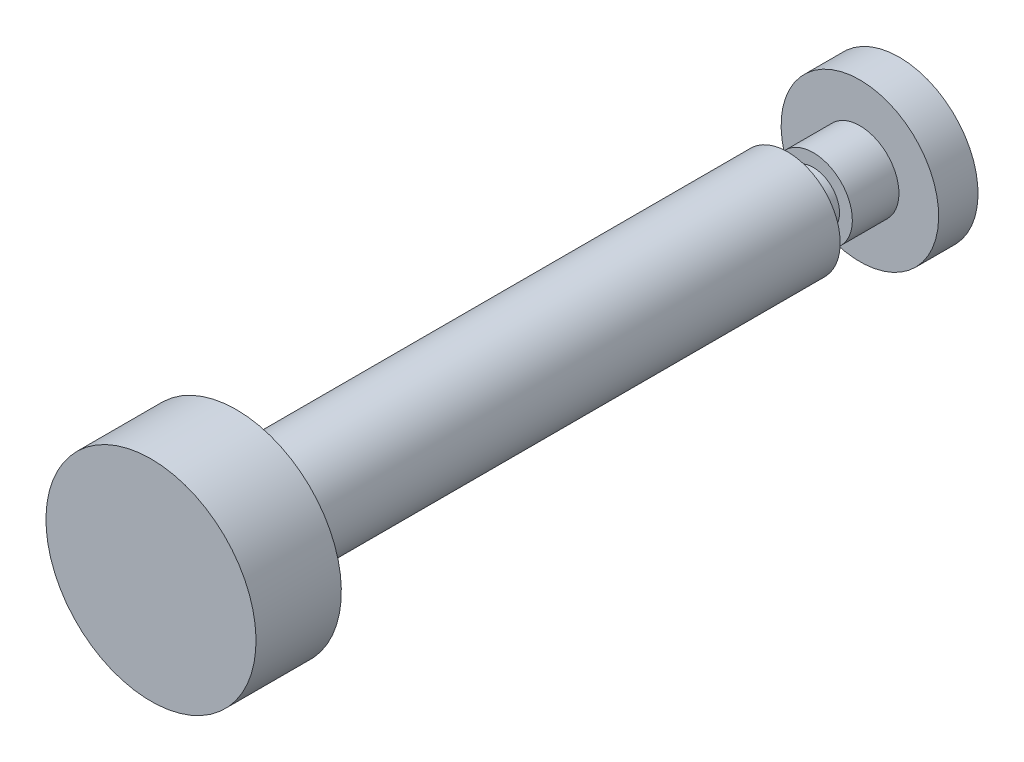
ISO-10303-21;
HEADER;
FILE_DESCRIPTION(('STEP AP214'),'2;1');
FILE_NAME('part.step','',(''),(''),'','','');
FILE_SCHEMA(('AUTOMOTIVE_DESIGN { 1 0 10303 214 1 1 1 1 }'));
ENDSEC;
DATA;
#1=APPLICATION_CONTEXT('core data for automotive mechanical design processes');
#2=APPLICATION_PROTOCOL_DEFINITION('international standard','automotive_design',2000,#1);
#3=PRODUCT_CONTEXT('',#1,'mechanical');
#4=PRODUCT('Part','Part','',(#3));
#5=PRODUCT_RELATED_PRODUCT_CATEGORY('part','',(#4));
#6=PRODUCT_DEFINITION_FORMATION('','',#4);
#7=PRODUCT_DEFINITION_CONTEXT('part definition',#1,'design');
#8=PRODUCT_DEFINITION('design','',#6,#7);
#9=PRODUCT_DEFINITION_SHAPE('','',#8);
#10=(LENGTH_UNIT() NAMED_UNIT(*) SI_UNIT(.MILLI.,.METRE.));
#11=(NAMED_UNIT(*) PLANE_ANGLE_UNIT() SI_UNIT($,.RADIAN.));
#12=(NAMED_UNIT(*) SI_UNIT($,.STERADIAN.) SOLID_ANGLE_UNIT());
#13=UNCERTAINTY_MEASURE_WITH_UNIT(LENGTH_MEASURE(1.E-05),#10,'distance_accuracy_value','');
#14=(GEOMETRIC_REPRESENTATION_CONTEXT(3) GLOBAL_UNCERTAINTY_ASSIGNED_CONTEXT((#13)) GLOBAL_UNIT_ASSIGNED_CONTEXT((#10,
#11,#12)) REPRESENTATION_CONTEXT('',''));
#15=CARTESIAN_POINT('',(0.,0.,0.));
#16=DIRECTION('',(0.,0.,1.));
#17=DIRECTION('',(1.,0.,0.));
#18=AXIS2_PLACEMENT_3D('',#15,#16,#17);
#19=CARTESIAN_POINT('',(0.,0.,0.));
#20=DIRECTION('',(0.,0.,1.));
#21=DIRECTION('',(0.,1.,0.));
#22=AXIS2_PLACEMENT_3D('',#19,#20,#21);
#23=PLANE('',#22);
#24=CARTESIAN_POINT('',(0.,0.,0.));
#25=DIRECTION('',(0.,0.,1.));
#26=DIRECTION('',(0.,1.,0.));
#27=AXIS2_PLACEMENT_3D('',#24,#25,#26);
#28=CIRCLE('',#27,12.);
#29=CARTESIAN_POINT('',(0.,12.,0.));
#30=VERTEX_POINT('',#29);
#31=EDGE_CURVE('E8',#30,#30,#28,.T.);
#32=ORIENTED_EDGE('',*,*,#31,.F.);
#33=EDGE_LOOP('',(#32));
#34=FACE_BOUND('',#33,.T.);
#35=ADVANCED_FACE('F12',(#34),#23,.F.);
#36=CARTESIAN_POINT('',(0.,0.,40.));
#37=DIRECTION('',(0.,0.,1.));
#38=DIRECTION('',(0.,1.,0.));
#39=AXIS2_PLACEMENT_3D('',#36,#37,#38);
#40=CYLINDRICAL_SURFACE('',#39,12.);
#41=CARTESIAN_POINT('',(0.,0.,6.));
#42=DIRECTION('',(0.,0.,1.));
#43=DIRECTION('',(0.,1.,0.));
#44=AXIS2_PLACEMENT_3D('',#41,#42,#43);
#45=CIRCLE('',#44,12.);
#46=CARTESIAN_POINT('',(0.,12.,6.));
#47=VERTEX_POINT('',#46);
#48=EDGE_CURVE('E18',#47,#47,#45,.T.);
#49=ORIENTED_EDGE('',*,*,#48,.F.);
#50=EDGE_LOOP('',(#49));
#51=FACE_BOUND('',#50,.T.);
#52=ORIENTED_EDGE('',*,*,#31,.T.);
#53=EDGE_LOOP('',(#52));
#54=FACE_BOUND('',#53,.T.);
#55=ADVANCED_FACE('F67',(#51,#54),#40,.T.);
#56=CARTESIAN_POINT('',(0.,-12.,6.));
#57=DIRECTION('',(0.,0.,-1.));
#58=DIRECTION('',(0.,-1.,0.));
#59=AXIS2_PLACEMENT_3D('',#56,#57,#58);
#60=PLANE('',#59);
#61=CARTESIAN_POINT('',(0.,0.,6.));
#62=DIRECTION('',(0.,0.,1.));
#63=DIRECTION('',(0.,1.,0.));
#64=AXIS2_PLACEMENT_3D('',#61,#62,#63);
#65=CIRCLE('',#64,5.95);
#66=CARTESIAN_POINT('',(0.,5.95,6.));
#67=VERTEX_POINT('',#66);
#68=EDGE_CURVE('E22',#67,#67,#65,.T.);
#69=ORIENTED_EDGE('',*,*,#68,.F.);
#70=EDGE_LOOP('',(#69));
#71=FACE_BOUND('',#70,.T.);
#72=ORIENTED_EDGE('',*,*,#48,.T.);
#73=EDGE_LOOP('',(#72));
#74=FACE_BOUND('',#73,.T.);
#75=ADVANCED_FACE('F72',(#71,#74),#60,.F.);
#76=CARTESIAN_POINT('',(0.,0.,40.));
#77=DIRECTION('',(0.,0.,1.));
#78=DIRECTION('',(0.,1.,0.));
#79=AXIS2_PLACEMENT_3D('',#76,#77,#78);
#80=CYLINDRICAL_SURFACE('',#79,5.95);
#81=CARTESIAN_POINT('',(0.,0.,13.1));
#82=DIRECTION('',(0.,0.,1.));
#83=DIRECTION('',(0.,1.,0.));
#84=AXIS2_PLACEMENT_3D('',#81,#82,#83);
#85=CIRCLE('',#84,5.95);
#86=CARTESIAN_POINT('',(0.,5.95,13.1));
#87=VERTEX_POINT('',#86);
#88=EDGE_CURVE('E26',#87,#87,#85,.T.);
#89=ORIENTED_EDGE('',*,*,#88,.F.);
#90=EDGE_LOOP('',(#89));
#91=FACE_BOUND('',#90,.T.);
#92=ORIENTED_EDGE('',*,*,#68,.T.);
#93=EDGE_LOOP('',(#92));
#94=FACE_BOUND('',#93,.T.);
#95=ADVANCED_FACE('F77',(#91,#94),#80,.T.);
#96=CARTESIAN_POINT('',(0.,-5.95,13.1));
#97=DIRECTION('',(0.,0.,-1.));
#98=DIRECTION('',(0.,-1.,0.));
#99=AXIS2_PLACEMENT_3D('',#96,#97,#98);
#100=PLANE('',#99);
#101=CARTESIAN_POINT('',(0.,0.,13.1));
#102=DIRECTION('',(0.,0.,1.));
#103=DIRECTION('',(0.,1.,0.));
#104=AXIS2_PLACEMENT_3D('',#101,#102,#103);
#105=CIRCLE('',#104,4.);
#106=CARTESIAN_POINT('',(0.,4.,13.1));
#107=VERTEX_POINT('',#106);
#108=EDGE_CURVE('E31',#107,#107,#105,.T.);
#109=ORIENTED_EDGE('',*,*,#108,.F.);
#110=EDGE_LOOP('',(#109));
#111=FACE_BOUND('',#110,.T.);
#112=ORIENTED_EDGE('',*,*,#88,.T.);
#113=EDGE_LOOP('',(#112));
#114=FACE_BOUND('',#113,.T.);
#115=ADVANCED_FACE('F83',(#111,#114),#100,.F.);
#116=CARTESIAN_POINT('',(0.,0.,40.));
#117=DIRECTION('',(0.,0.,1.));
#118=DIRECTION('',(0.,1.,0.));
#119=AXIS2_PLACEMENT_3D('',#116,#117,#118);
#120=CYLINDRICAL_SURFACE('',#119,4.);
#121=CARTESIAN_POINT('',(0.,0.,17.));
#122=DIRECTION('',(0.,0.,1.));
#123=DIRECTION('',(0.,1.,0.));
#124=AXIS2_PLACEMENT_3D('',#121,#122,#123);
#125=CIRCLE('',#124,4.);
#126=CARTESIAN_POINT('',(0.,4.,17.));
#127=VERTEX_POINT('',#126);
#128=EDGE_CURVE('E34',#127,#127,#125,.T.);
#129=ORIENTED_EDGE('',*,*,#128,.F.);
#130=EDGE_LOOP('',(#129));
#131=FACE_BOUND('',#130,.T.);
#132=ORIENTED_EDGE('',*,*,#108,.T.);
#133=EDGE_LOOP('',(#132));
#134=FACE_BOUND('',#133,.T.);
#135=ADVANCED_FACE('F87',(#131,#134),#120,.T.);
#136=CARTESIAN_POINT('',(0.,-4.,17.));
#137=DIRECTION('',(0.,0.,1.));
#138=DIRECTION('',(0.,1.,0.));
#139=AXIS2_PLACEMENT_3D('',#136,#137,#138);
#140=PLANE('',#139);
#141=CARTESIAN_POINT('',(0.,0.,17.));
#142=DIRECTION('',(0.,0.,1.));
#143=DIRECTION('',(0.,1.,0.));
#144=AXIS2_PLACEMENT_3D('',#141,#142,#143);
#145=CIRCLE('',#144,8.);
#146=CARTESIAN_POINT('',(0.,8.,17.));
#147=VERTEX_POINT('',#146);
#148=EDGE_CURVE('E37',#147,#147,#145,.T.);
#149=ORIENTED_EDGE('',*,*,#148,.F.);
#150=EDGE_LOOP('',(#149));
#151=FACE_BOUND('',#150,.T.);
#152=ORIENTED_EDGE('',*,*,#128,.T.);
#153=EDGE_LOOP('',(#152));
#154=FACE_BOUND('',#153,.T.);
#155=ADVANCED_FACE('F91',(#151,#154),#140,.F.);
#156=CARTESIAN_POINT('',(0.,0.,40.));
#157=DIRECTION('',(0.,0.,1.));
#158=DIRECTION('',(0.,1.,0.));
#159=AXIS2_PLACEMENT_3D('',#156,#157,#158);
#160=CYLINDRICAL_SURFACE('',#159,8.);
#161=CARTESIAN_POINT('',(0.,0.,101.));
#162=DIRECTION('',(0.,0.,1.));
#163=DIRECTION('',(0.,1.,0.));
#164=AXIS2_PLACEMENT_3D('',#161,#162,#163);
#165=CIRCLE('',#164,8.);
#166=CARTESIAN_POINT('',(0.,8.,101.));
#167=VERTEX_POINT('',#166);
#168=EDGE_CURVE('E40',#167,#167,#165,.T.);
#169=ORIENTED_EDGE('',*,*,#168,.F.);
#170=EDGE_LOOP('',(#169));
#171=FACE_BOUND('',#170,.T.);
#172=ORIENTED_EDGE('',*,*,#148,.T.);
#173=EDGE_LOOP('',(#172));
#174=FACE_BOUND('',#173,.T.);
#175=ADVANCED_FACE('F63',(#171,#174),#160,.T.);
#176=CARTESIAN_POINT('',(0.,-16.,101.));
#177=DIRECTION('',(0.,0.,-1.));
#178=DIRECTION('',(0.,-1.,0.));
#179=AXIS2_PLACEMENT_3D('',#176,#177,#178);
#180=PLANE('',#179);
#181=ORIENTED_EDGE('',*,*,#168,.T.);
#182=EDGE_LOOP('',(#181));
#183=FACE_BOUND('',#182,.T.);
#184=CARTESIAN_POINT('',(0.,0.,101.));
#185=DIRECTION('',(0.,0.,1.));
#186=DIRECTION('',(0.,1.,0.));
#187=AXIS2_PLACEMENT_3D('',#184,#185,#186);
#188=CIRCLE('',#187,16.);
#189=CARTESIAN_POINT('',(0.,16.,101.));
#190=VERTEX_POINT('',#189);
#191=EDGE_CURVE('E43',#190,#190,#188,.T.);
#192=ORIENTED_EDGE('',*,*,#191,.F.);
#193=EDGE_LOOP('',(#192));
#194=FACE_BOUND('',#193,.T.);
#195=ADVANCED_FACE('F54',(#183,#194),#180,.T.);
#196=CARTESIAN_POINT('',(0.,0.,40.));
#197=DIRECTION('',(0.,0.,1.));
#198=DIRECTION('',(0.,1.,0.));
#199=AXIS2_PLACEMENT_3D('',#196,#197,#198);
#200=CYLINDRICAL_SURFACE('',#199,16.);
#201=ORIENTED_EDGE('',*,*,#191,.T.);
#202=EDGE_LOOP('',(#201));
#203=FACE_BOUND('',#202,.T.);
#204=CARTESIAN_POINT('',(0.,0.,114.));
#205=DIRECTION('',(0.,0.,1.));
#206=DIRECTION('',(0.,1.,0.));
#207=AXIS2_PLACEMENT_3D('',#204,#205,#206);
#208=CIRCLE('',#207,16.);
#209=CARTESIAN_POINT('',(0.,16.,114.));
#210=VERTEX_POINT('',#209);
#211=EDGE_CURVE('E46',#210,#210,#208,.T.);
#212=ORIENTED_EDGE('',*,*,#211,.F.);
#213=EDGE_LOOP('',(#212));
#214=FACE_BOUND('',#213,.T.);
#215=ADVANCED_FACE('F52',(#203,#214),#200,.T.);
#216=CARTESIAN_POINT('',(0.,-16.,114.));
#217=DIRECTION('',(0.,0.,-1.));
#218=DIRECTION('',(0.,-1.,0.));
#219=AXIS2_PLACEMENT_3D('',#216,#217,#218);
#220=PLANE('',#219);
#221=ORIENTED_EDGE('',*,*,#211,.T.);
#222=EDGE_LOOP('',(#221));
#223=FACE_BOUND('',#222,.T.);
#224=ADVANCED_FACE('F50',(#223),#220,.F.);
#225=CLOSED_SHELL('',(#35,#55,#75,#95,#115,#135,#155,#175,#195,#215,#224));
#226=MANIFOLD_SOLID_BREP('B1',#225);
#227=ADVANCED_BREP_SHAPE_REPRESENTATION('',(#18,#226),#14);
#228=SHAPE_DEFINITION_REPRESENTATION(#9,#227);
ENDSEC;
END-ISO-10303-21;
